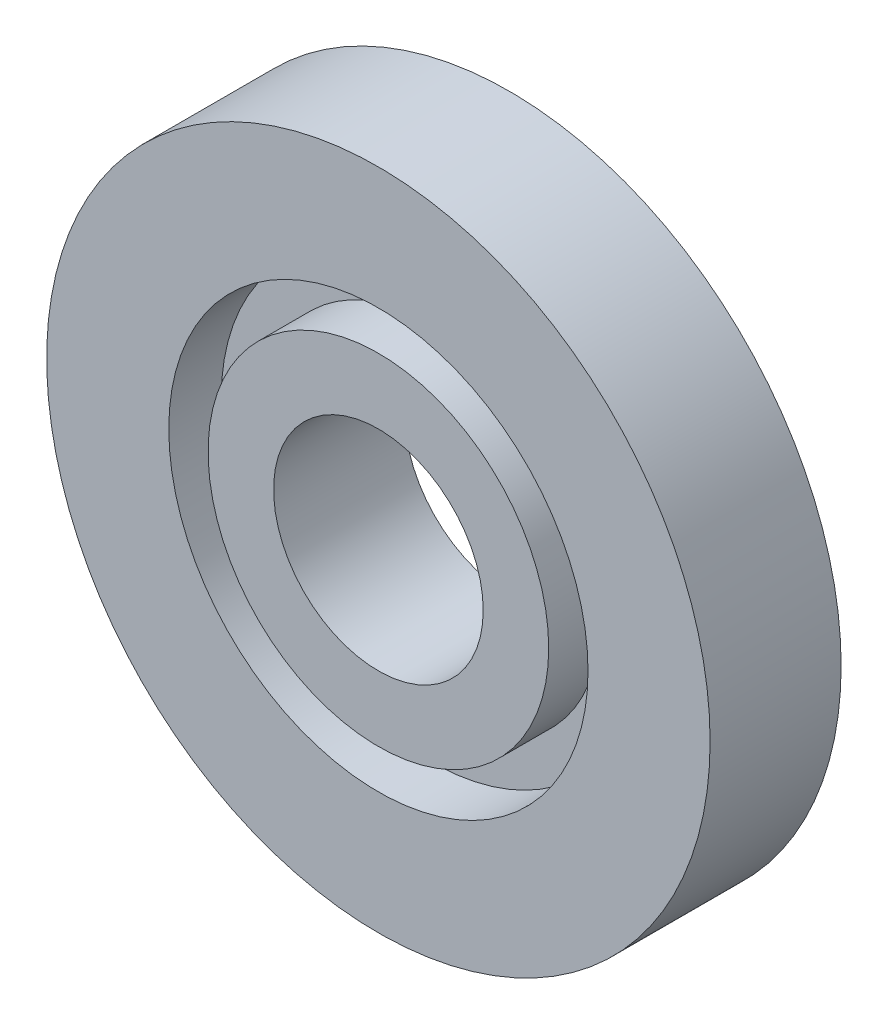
ISO-10303-21;
HEADER;
FILE_DESCRIPTION(('STEP AP214'),'2;1');
FILE_NAME('part.step','',(''),(''),'','','');
FILE_SCHEMA(('AUTOMOTIVE_DESIGN { 1 0 10303 214 1 1 1 1 }'));
ENDSEC;
DATA;
#1=APPLICATION_CONTEXT('core data for automotive mechanical design processes');
#2=APPLICATION_PROTOCOL_DEFINITION('international standard','automotive_design',2000,#1);
#3=PRODUCT_CONTEXT('',#1,'mechanical');
#4=PRODUCT('Part','Part','',(#3));
#5=PRODUCT_RELATED_PRODUCT_CATEGORY('part','',(#4));
#6=PRODUCT_DEFINITION_FORMATION('','',#4);
#7=PRODUCT_DEFINITION_CONTEXT('part definition',#1,'design');
#8=PRODUCT_DEFINITION('design','',#6,#7);
#9=PRODUCT_DEFINITION_SHAPE('','',#8);
#10=(LENGTH_UNIT() NAMED_UNIT(*) SI_UNIT(.MILLI.,.METRE.));
#11=(NAMED_UNIT(*) PLANE_ANGLE_UNIT() SI_UNIT($,.RADIAN.));
#12=(NAMED_UNIT(*) SI_UNIT($,.STERADIAN.) SOLID_ANGLE_UNIT());
#13=UNCERTAINTY_MEASURE_WITH_UNIT(LENGTH_MEASURE(1.E-05),#10,'distance_accuracy_value','');
#14=(GEOMETRIC_REPRESENTATION_CONTEXT(3) GLOBAL_UNCERTAINTY_ASSIGNED_CONTEXT((#13)) GLOBAL_UNIT_ASSIGNED_CONTEXT((#10,
#11,#12)) REPRESENTATION_CONTEXT('',''));
#15=CARTESIAN_POINT('',(0.,0.,0.));
#16=DIRECTION('',(0.,0.,1.));
#17=DIRECTION('',(1.,0.,0.));
#18=AXIS2_PLACEMENT_3D('',#15,#16,#17);
#19=CARTESIAN_POINT('',(0.,0.,0.));
#20=DIRECTION('',(0.,0.,1.));
#21=DIRECTION('',(1.,0.,0.));
#22=AXIS2_PLACEMENT_3D('',#19,#20,#21);
#23=PLANE('',#22);
#24=CARTESIAN_POINT('',(0.,0.,0.));
#25=DIRECTION('',(0.,0.,1.));
#26=DIRECTION('',(1.,0.,0.));
#27=AXIS2_PLACEMENT_3D('',#24,#25,#26);
#28=CIRCLE('',#27,2.);
#29=CARTESIAN_POINT('',(2.,0.,0.));
#30=VERTEX_POINT('',#29);
#31=EDGE_CURVE('E70',#30,#30,#28,.T.);
#32=ORIENTED_EDGE('',*,*,#31,.T.);
#33=EDGE_LOOP('',(#32));
#34=FACE_BOUND('',#33,.T.);
#35=CARTESIAN_POINT('',(0.,0.,0.));
#36=DIRECTION('',(0.,0.,-1.));
#37=DIRECTION('',(-1.,0.,0.));
#38=AXIS2_PLACEMENT_3D('',#35,#36,#37);
#39=CIRCLE('',#38,3.25);
#40=CARTESIAN_POINT('',(-3.25,0.,0.));
#41=VERTEX_POINT('',#40);
#42=EDGE_CURVE('E104',#41,#41,#39,.T.);
#43=ORIENTED_EDGE('',*,*,#42,.T.);
#44=EDGE_LOOP('',(#43));
#45=FACE_BOUND('',#44,.T.);
#46=ADVANCED_FACE('F57',(#34,#45),#23,.F.);
#47=CARTESIAN_POINT('',(0.,0.,2.5));
#48=DIRECTION('',(0.,0.,1.));
#49=DIRECTION('',(1.,0.,0.));
#50=AXIS2_PLACEMENT_3D('',#47,#48,#49);
#51=PLANE('',#50);
#52=CARTESIAN_POINT('',(0.,0.,2.5));
#53=DIRECTION('',(0.,0.,1.));
#54=DIRECTION('',(1.,0.,0.));
#55=AXIS2_PLACEMENT_3D('',#52,#53,#54);
#56=CIRCLE('',#55,2.);
#57=CARTESIAN_POINT('',(2.,0.,2.5));
#58=VERTEX_POINT('',#57);
#59=EDGE_CURVE('E75',#58,#58,#56,.T.);
#60=ORIENTED_EDGE('',*,*,#59,.F.);
#61=EDGE_LOOP('',(#60));
#62=FACE_BOUND('',#61,.T.);
#63=CARTESIAN_POINT('',(0.,0.,2.5));
#64=DIRECTION('',(0.,0.,1.));
#65=DIRECTION('',(1.,0.,0.));
#66=AXIS2_PLACEMENT_3D('',#63,#64,#65);
#67=CIRCLE('',#66,3.25);
#68=CARTESIAN_POINT('',(3.25,0.,2.5));
#69=VERTEX_POINT('',#68);
#70=EDGE_CURVE('E79',#69,#69,#67,.T.);
#71=ORIENTED_EDGE('',*,*,#70,.T.);
#72=EDGE_LOOP('',(#71));
#73=FACE_BOUND('',#72,.T.);
#74=ADVANCED_FACE('F131',(#62,#73),#51,.T.);
#75=CARTESIAN_POINT('',(0.,0.,0.));
#76=DIRECTION('',(0.,0.,-1.));
#77=DIRECTION('',(-1.,0.,0.));
#78=AXIS2_PLACEMENT_3D('',#75,#76,#77);
#79=CIRCLE('',#78,4.);
#80=CARTESIAN_POINT('',(-4.,0.,0.));
#81=VERTEX_POINT('',#80);
#82=EDGE_CURVE('E96',#81,#81,#79,.T.);
#83=ORIENTED_EDGE('',*,*,#82,.F.);
#84=EDGE_LOOP('',(#83));
#85=FACE_BOUND('',#84,.T.);
#86=CARTESIAN_POINT('',(0.,0.,0.));
#87=DIRECTION('',(0.,0.,1.));
#88=DIRECTION('',(1.,0.,0.));
#89=AXIS2_PLACEMENT_3D('',#86,#87,#88);
#90=CIRCLE('',#89,6.33);
#91=CARTESIAN_POINT('',(6.33,0.,0.));
#92=VERTEX_POINT('',#91);
#93=EDGE_CURVE('E61',#92,#92,#90,.T.);
#94=ORIENTED_EDGE('',*,*,#93,.F.);
#95=EDGE_LOOP('',(#94));
#96=FACE_BOUND('',#95,.T.);
#97=ADVANCED_FACE('F128',(#85,#96),#23,.F.);
#98=CARTESIAN_POINT('',(0.,0.,2.5));
#99=DIRECTION('',(0.,0.,-1.));
#100=DIRECTION('',(-1.,0.,0.));
#101=AXIS2_PLACEMENT_3D('',#98,#99,#100);
#102=CYLINDRICAL_SURFACE('',#101,6.33);
#103=CARTESIAN_POINT('',(0.,0.,2.5));
#104=DIRECTION('',(0.,0.,1.));
#105=DIRECTION('',(1.,0.,0.));
#106=AXIS2_PLACEMENT_3D('',#103,#104,#105);
#107=CIRCLE('',#106,6.33);
#108=CARTESIAN_POINT('',(6.33,0.,2.5));
#109=VERTEX_POINT('',#108);
#110=EDGE_CURVE('E11',#109,#109,#107,.T.);
#111=ORIENTED_EDGE('',*,*,#110,.F.);
#112=EDGE_LOOP('',(#111));
#113=FACE_BOUND('',#112,.T.);
#114=ORIENTED_EDGE('',*,*,#93,.T.);
#115=EDGE_LOOP('',(#114));
#116=FACE_BOUND('',#115,.T.);
#117=ADVANCED_FACE('F59',(#113,#116),#102,.T.);
#118=CARTESIAN_POINT('',(0.,0.,2.5));
#119=DIRECTION('',(0.,0.,1.));
#120=DIRECTION('',(1.,0.,0.));
#121=AXIS2_PLACEMENT_3D('',#118,#119,#120);
#122=CIRCLE('',#121,4.);
#123=CARTESIAN_POINT('',(4.,0.,2.5));
#124=VERTEX_POINT('',#123);
#125=EDGE_CURVE('E84',#124,#124,#122,.T.);
#126=ORIENTED_EDGE('',*,*,#125,.F.);
#127=EDGE_LOOP('',(#126));
#128=FACE_BOUND('',#127,.T.);
#129=ORIENTED_EDGE('',*,*,#110,.T.);
#130=EDGE_LOOP('',(#129));
#131=FACE_BOUND('',#130,.T.);
#132=ADVANCED_FACE('F132',(#128,#131),#51,.T.);
#133=CARTESIAN_POINT('',(0.,0.,-2.5));
#134=DIRECTION('',(0.,0.,1.));
#135=DIRECTION('',(1.,0.,0.));
#136=AXIS2_PLACEMENT_3D('',#133,#134,#135);
#137=CYLINDRICAL_SURFACE('',#136,2.);
#138=ORIENTED_EDGE('',*,*,#59,.T.);
#139=EDGE_LOOP('',(#138));
#140=FACE_BOUND('',#139,.T.);
#141=ORIENTED_EDGE('',*,*,#31,.F.);
#142=EDGE_LOOP('',(#141));
#143=FACE_BOUND('',#142,.T.);
#144=ADVANCED_FACE('F141',(#140,#143),#137,.F.);
#145=CARTESIAN_POINT('',(0.,0.,1.5));
#146=DIRECTION('',(0.,0.,1.));
#147=DIRECTION('',(1.,0.,0.));
#148=AXIS2_PLACEMENT_3D('',#145,#146,#147);
#149=CYLINDRICAL_SURFACE('',#148,4.);
#150=CARTESIAN_POINT('',(0.,0.,1.5));
#151=DIRECTION('',(0.,0.,1.));
#152=DIRECTION('',(1.,0.,0.));
#153=AXIS2_PLACEMENT_3D('',#150,#151,#152);
#154=CIRCLE('',#153,4.);
#155=CARTESIAN_POINT('',(4.,0.,1.5));
#156=VERTEX_POINT('',#155);
#157=EDGE_CURVE('E85',#156,#156,#154,.T.);
#158=ORIENTED_EDGE('',*,*,#157,.F.);
#159=EDGE_LOOP('',(#158));
#160=FACE_BOUND('',#159,.T.);
#161=ORIENTED_EDGE('',*,*,#125,.T.);
#162=EDGE_LOOP('',(#161));
#163=FACE_BOUND('',#162,.T.);
#164=ADVANCED_FACE('F154',(#160,#163),#149,.F.);
#165=CARTESIAN_POINT('',(0.,0.,1.5));
#166=DIRECTION('',(0.,0.,1.));
#167=DIRECTION('',(1.,0.,0.));
#168=AXIS2_PLACEMENT_3D('',#165,#166,#167);
#169=PLANE('',#168);
#170=CARTESIAN_POINT('',(0.,0.,1.5));
#171=DIRECTION('',(0.,0.,1.));
#172=DIRECTION('',(1.,0.,0.));
#173=AXIS2_PLACEMENT_3D('',#170,#171,#172);
#174=CIRCLE('',#173,3.25);
#175=CARTESIAN_POINT('',(3.25,0.,1.5));
#176=VERTEX_POINT('',#175);
#177=EDGE_CURVE('E80',#176,#176,#174,.T.);
#178=ORIENTED_EDGE('',*,*,#177,.F.);
#179=EDGE_LOOP('',(#178));
#180=FACE_BOUND('',#179,.T.);
#181=ORIENTED_EDGE('',*,*,#157,.T.);
#182=EDGE_LOOP('',(#181));
#183=FACE_BOUND('',#182,.T.);
#184=ADVANCED_FACE('F156',(#180,#183),#169,.T.);
#185=CARTESIAN_POINT('',(0.,0.,1.5));
#186=DIRECTION('',(0.,0.,1.));
#187=DIRECTION('',(1.,0.,0.));
#188=AXIS2_PLACEMENT_3D('',#185,#186,#187);
#189=CYLINDRICAL_SURFACE('',#188,3.25);
#190=ORIENTED_EDGE('',*,*,#177,.T.);
#191=EDGE_LOOP('',(#190));
#192=FACE_BOUND('',#191,.T.);
#193=ORIENTED_EDGE('',*,*,#70,.F.);
#194=EDGE_LOOP('',(#193));
#195=FACE_BOUND('',#194,.T.);
#196=ADVANCED_FACE('F124',(#192,#195),#189,.T.);
#197=CARTESIAN_POINT('',(0.,0.,1.));
#198=DIRECTION('',(0.,0.,-1.));
#199=DIRECTION('',(-1.,0.,0.));
#200=AXIS2_PLACEMENT_3D('',#197,#198,#199);
#201=CYLINDRICAL_SURFACE('',#200,4.);
#202=CARTESIAN_POINT('',(0.,0.,1.));
#203=DIRECTION('',(0.,0.,-1.));
#204=DIRECTION('',(-1.,0.,0.));
#205=AXIS2_PLACEMENT_3D('',#202,#203,#204);
#206=CIRCLE('',#205,4.);
#207=CARTESIAN_POINT('',(-4.,0.,1.));
#208=VERTEX_POINT('',#207);
#209=EDGE_CURVE('E92',#208,#208,#206,.T.);
#210=ORIENTED_EDGE('',*,*,#209,.F.);
#211=EDGE_LOOP('',(#210));
#212=FACE_BOUND('',#211,.T.);
#213=ORIENTED_EDGE('',*,*,#82,.T.);
#214=EDGE_LOOP('',(#213));
#215=FACE_BOUND('',#214,.T.);
#216=ADVANCED_FACE('F118',(#212,#215),#201,.F.);
#217=CARTESIAN_POINT('',(0.,0.,1.));
#218=DIRECTION('',(0.,0.,-1.));
#219=DIRECTION('',(-1.,0.,0.));
#220=AXIS2_PLACEMENT_3D('',#217,#218,#219);
#221=PLANE('',#220);
#222=CARTESIAN_POINT('',(0.,0.,1.));
#223=DIRECTION('',(0.,0.,-1.));
#224=DIRECTION('',(-1.,0.,0.));
#225=AXIS2_PLACEMENT_3D('',#222,#223,#224);
#226=CIRCLE('',#225,3.25);
#227=CARTESIAN_POINT('',(-3.25,0.,1.));
#228=VERTEX_POINT('',#227);
#229=EDGE_CURVE('E100',#228,#228,#226,.T.);
#230=ORIENTED_EDGE('',*,*,#229,.F.);
#231=EDGE_LOOP('',(#230));
#232=FACE_BOUND('',#231,.T.);
#233=ORIENTED_EDGE('',*,*,#209,.T.);
#234=EDGE_LOOP('',(#233));
#235=FACE_BOUND('',#234,.T.);
#236=ADVANCED_FACE('F115',(#232,#235),#221,.T.);
#237=CARTESIAN_POINT('',(0.,0.,1.));
#238=DIRECTION('',(0.,0.,-1.));
#239=DIRECTION('',(-1.,0.,0.));
#240=AXIS2_PLACEMENT_3D('',#237,#238,#239);
#241=CYLINDRICAL_SURFACE('',#240,3.25);
#242=ORIENTED_EDGE('',*,*,#229,.T.);
#243=EDGE_LOOP('',(#242));
#244=FACE_BOUND('',#243,.T.);
#245=ORIENTED_EDGE('',*,*,#42,.F.);
#246=EDGE_LOOP('',(#245));
#247=FACE_BOUND('',#246,.T.);
#248=ADVANCED_FACE('F112',(#244,#247),#241,.T.);
#249=CLOSED_SHELL('',(#46,#74,#97,#117,#132,#144,#164,#184,#196,#216,#236,#248));
#250=MANIFOLD_SOLID_BREP('B2',#249);
#251=ADVANCED_BREP_SHAPE_REPRESENTATION('',(#18,#250),#14);
#252=SHAPE_DEFINITION_REPRESENTATION(#9,#251);
ENDSEC;
END-ISO-10303-21;
